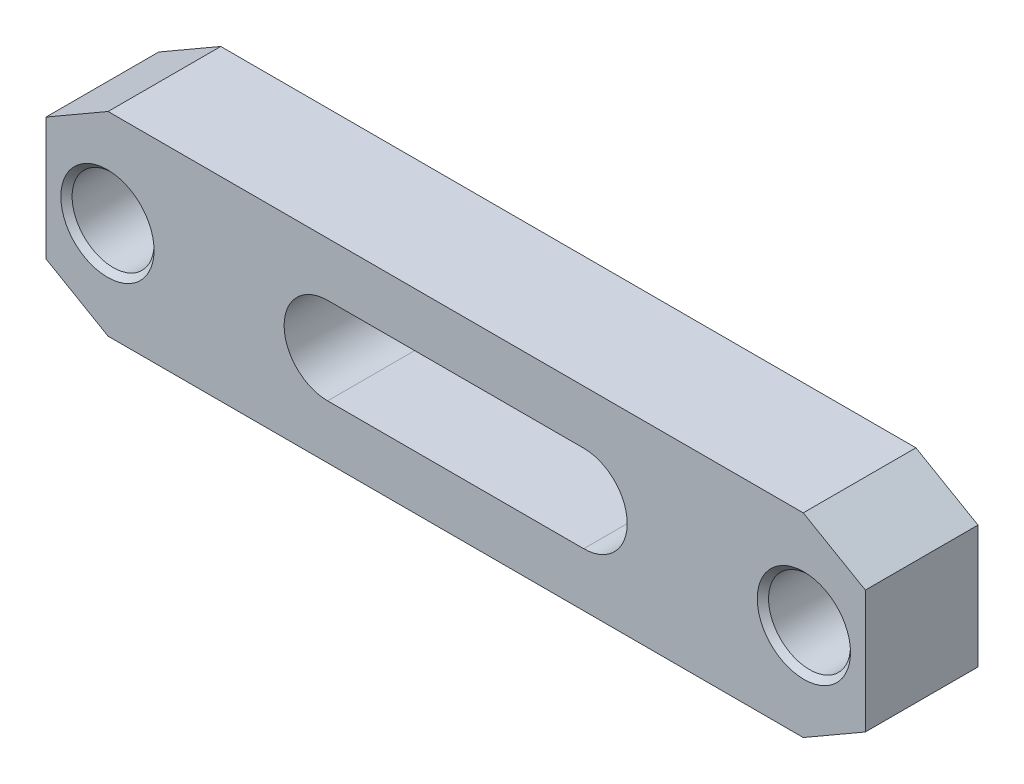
ISO-10303-21;
HEADER;
FILE_DESCRIPTION(('STEP AP214'),'2;1');
FILE_NAME('part.step','',(''),(''),'','','');
FILE_SCHEMA(('AUTOMOTIVE_DESIGN { 1 0 10303 214 1 1 1 1 }'));
ENDSEC;
DATA;
#1=APPLICATION_CONTEXT('core data for automotive mechanical design processes');
#2=APPLICATION_PROTOCOL_DEFINITION('international standard','automotive_design',2000,#1);
#3=PRODUCT_CONTEXT('',#1,'mechanical');
#4=PRODUCT('Part','Part','',(#3));
#5=PRODUCT_RELATED_PRODUCT_CATEGORY('part','',(#4));
#6=PRODUCT_DEFINITION_FORMATION('','',#4);
#7=PRODUCT_DEFINITION_CONTEXT('part definition',#1,'design');
#8=PRODUCT_DEFINITION('design','',#6,#7);
#9=PRODUCT_DEFINITION_SHAPE('','',#8);
#10=(LENGTH_UNIT() NAMED_UNIT(*) SI_UNIT(.MILLI.,.METRE.));
#11=(NAMED_UNIT(*) PLANE_ANGLE_UNIT() SI_UNIT($,.RADIAN.));
#12=(NAMED_UNIT(*) SI_UNIT($,.STERADIAN.) SOLID_ANGLE_UNIT());
#13=UNCERTAINTY_MEASURE_WITH_UNIT(LENGTH_MEASURE(1.E-05),#10,'distance_accuracy_value','');
#14=(GEOMETRIC_REPRESENTATION_CONTEXT(3) GLOBAL_UNCERTAINTY_ASSIGNED_CONTEXT((#13)) GLOBAL_UNIT_ASSIGNED_CONTEXT((#10,
#11,#12)) REPRESENTATION_CONTEXT('',''));
#15=CARTESIAN_POINT('',(0.,0.,0.));
#16=DIRECTION('',(0.,0.,1.));
#17=DIRECTION('',(1.,0.,0.));
#18=AXIS2_PLACEMENT_3D('',#15,#16,#17);
#19=CARTESIAN_POINT('',(80.,-19.,22.));
#20=DIRECTION('',(0.,0.,1.));
#21=DIRECTION('',(1.,0.,0.));
#22=AXIS2_PLACEMENT_3D('',#19,#20,#21);
#23=PLANE('',#22);
#24=CARTESIAN_POINT('',(68.,0.,22.));
#25=DIRECTION('',(0.,0.,-1.));
#26=DIRECTION('',(-1.,0.,0.));
#27=AXIS2_PLACEMENT_3D('',#24,#25,#26);
#28=CIRCLE('',#27,9.1);
#29=CARTESIAN_POINT('',(58.9,0.,22.));
#30=VERTEX_POINT('',#29);
#31=EDGE_CURVE('E212',#30,#30,#28,.T.);
#32=ORIENTED_EDGE('',*,*,#31,.T.);
#33=EDGE_LOOP('',(#32));
#34=FACE_BOUND('',#33,.T.);
#35=CARTESIAN_POINT('',(-68.,0.,22.));
#36=DIRECTION('',(0.,0.,-1.));
#37=DIRECTION('',(-1.,0.,0.));
#38=AXIS2_PLACEMENT_3D('',#35,#36,#37);
#39=CIRCLE('',#38,9.1);
#40=CARTESIAN_POINT('',(-77.1,0.,22.));
#41=VERTEX_POINT('',#40);
#42=EDGE_CURVE('E133',#41,#41,#39,.T.);
#43=ORIENTED_EDGE('',*,*,#42,.T.);
#44=EDGE_LOOP('',(#43));
#45=FACE_BOUND('',#44,.T.);
#46=DIRECTION('',(1.,0.,0.));
#47=VECTOR('',#46,1.);
#48=CARTESIAN_POINT('',(-67.8756443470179,-19.,22.));
#49=LINE('',#48,#47);
#50=CARTESIAN_POINT('',(-67.8756443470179,-19.,22.));
#51=VERTEX_POINT('',#50);
#52=CARTESIAN_POINT('',(67.8756443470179,-19.,22.));
#53=VERTEX_POINT('',#52);
#54=EDGE_CURVE('E143',#51,#53,#49,.T.);
#55=ORIENTED_EDGE('',*,*,#54,.T.);
#56=DIRECTION('',(0.866025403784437,0.5,0.));
#57=VECTOR('',#56,1.);
#58=CARTESIAN_POINT('',(67.8756443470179,-19.,22.));
#59=LINE('',#58,#57);
#60=CARTESIAN_POINT('',(80.,-12.,22.));
#61=VERTEX_POINT('',#60);
#62=EDGE_CURVE('E146',#53,#61,#59,.T.);
#63=ORIENTED_EDGE('',*,*,#62,.T.);
#64=DIRECTION('',(0.,1.,0.));
#65=VECTOR('',#64,1.);
#66=CARTESIAN_POINT('',(80.,-12.,22.));
#67=LINE('',#66,#65);
#68=CARTESIAN_POINT('',(80.,12.,22.));
#69=VERTEX_POINT('',#68);
#70=EDGE_CURVE('E149',#61,#69,#67,.T.);
#71=ORIENTED_EDGE('',*,*,#70,.T.);
#72=DIRECTION('',(-0.866025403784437,0.5,0.));
#73=VECTOR('',#72,1.);
#74=CARTESIAN_POINT('',(67.8756443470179,19.,22.));
#75=LINE('',#74,#73);
#76=CARTESIAN_POINT('',(67.8756443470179,19.,22.));
#77=VERTEX_POINT('',#76);
#78=EDGE_CURVE('E151',#69,#77,#75,.T.);
#79=ORIENTED_EDGE('',*,*,#78,.T.);
#80=DIRECTION('',(-1.,0.,0.));
#81=VECTOR('',#80,1.);
#82=CARTESIAN_POINT('',(-67.8756443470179,19.,22.));
#83=LINE('',#82,#81);
#84=CARTESIAN_POINT('',(-67.8756443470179,19.,22.));
#85=VERTEX_POINT('',#84);
#86=EDGE_CURVE('E153',#77,#85,#83,.T.);
#87=ORIENTED_EDGE('',*,*,#86,.T.);
#88=DIRECTION('',(-0.866025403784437,-0.5,0.));
#89=VECTOR('',#88,1.);
#90=CARTESIAN_POINT('',(-67.8756443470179,19.,22.));
#91=LINE('',#90,#89);
#92=CARTESIAN_POINT('',(-80.,12.,22.));
#93=VERTEX_POINT('',#92);
#94=EDGE_CURVE('E155',#85,#93,#91,.T.);
#95=ORIENTED_EDGE('',*,*,#94,.T.);
#96=DIRECTION('',(0.,-1.,0.));
#97=VECTOR('',#96,1.);
#98=CARTESIAN_POINT('',(-80.,-12.,22.));
#99=LINE('',#98,#97);
#100=CARTESIAN_POINT('',(-80.,-12.,22.));
#101=VERTEX_POINT('',#100);
#102=EDGE_CURVE('E157',#93,#101,#99,.T.);
#103=ORIENTED_EDGE('',*,*,#102,.T.);
#104=DIRECTION('',(0.866025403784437,-0.5,0.));
#105=VECTOR('',#104,1.);
#106=CARTESIAN_POINT('',(-67.8756443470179,-19.,22.));
#107=LINE('',#106,#105);
#108=EDGE_CURVE('E159',#101,#51,#107,.T.);
#109=ORIENTED_EDGE('',*,*,#108,.T.);
#110=EDGE_LOOP('',(#55,#63,#71,#79,#87,#95,#103,#109));
#111=FACE_BOUND('',#110,.T.);
#112=DIRECTION('',(-1.,0.,0.));
#113=VECTOR('',#112,1.);
#114=CARTESIAN_POINT('',(25.,8.5,22.));
#115=LINE('',#114,#113);
#116=CARTESIAN_POINT('',(25.,8.5,22.));
#117=VERTEX_POINT('',#116);
#118=CARTESIAN_POINT('',(-25.,8.5,22.));
#119=VERTEX_POINT('',#118);
#120=EDGE_CURVE('E113',#117,#119,#115,.T.);
#121=ORIENTED_EDGE('',*,*,#120,.F.);
#122=CARTESIAN_POINT('',(25.,0.,22.));
#123=DIRECTION('',(0.,0.,1.));
#124=DIRECTION('',(1.,0.,0.));
#125=AXIS2_PLACEMENT_3D('',#122,#123,#124);
#126=CIRCLE('',#125,8.5);
#127=CARTESIAN_POINT('',(25.,-8.5,22.));
#128=VERTEX_POINT('',#127);
#129=EDGE_CURVE('E105',#128,#117,#126,.T.);
#130=ORIENTED_EDGE('',*,*,#129,.F.);
#131=DIRECTION('',(1.,0.,0.));
#132=VECTOR('',#131,1.);
#133=CARTESIAN_POINT('',(25.,-8.5,22.));
#134=LINE('',#133,#132);
#135=CARTESIAN_POINT('',(-25.,-8.5,22.));
#136=VERTEX_POINT('',#135);
#137=EDGE_CURVE('E127',#136,#128,#134,.T.);
#138=ORIENTED_EDGE('',*,*,#137,.F.);
#139=CARTESIAN_POINT('',(-25.,0.,22.));
#140=DIRECTION('',(0.,0.,1.));
#141=DIRECTION('',(1.,0.,0.));
#142=AXIS2_PLACEMENT_3D('',#139,#140,#141);
#143=CIRCLE('',#142,8.5);
#144=EDGE_CURVE('E125',#119,#136,#143,.T.);
#145=ORIENTED_EDGE('',*,*,#144,.F.);
#146=EDGE_LOOP('',(#121,#130,#138,#145));
#147=FACE_BOUND('',#146,.T.);
#148=ADVANCED_FACE('F14',(#34,#45,#111,#147),#23,.T.);
#149=CARTESIAN_POINT('',(80.,-19.,0.));
#150=DIRECTION('',(0.,0.,1.));
#151=DIRECTION('',(1.,0.,0.));
#152=AXIS2_PLACEMENT_3D('',#149,#150,#151);
#153=PLANE('',#152);
#154=CARTESIAN_POINT('',(68.,0.,0.));
#155=DIRECTION('',(0.,0.,-1.));
#156=DIRECTION('',(-1.,0.,0.));
#157=AXIS2_PLACEMENT_3D('',#154,#155,#156);
#158=CIRCLE('',#157,9.1);
#159=CARTESIAN_POINT('',(58.9,0.,0.));
#160=VERTEX_POINT('',#159);
#161=EDGE_CURVE('E202',#160,#160,#158,.T.);
#162=ORIENTED_EDGE('',*,*,#161,.F.);
#163=EDGE_LOOP('',(#162));
#164=FACE_BOUND('',#163,.T.);
#165=CARTESIAN_POINT('',(-68.,0.,0.));
#166=DIRECTION('',(0.,0.,-1.));
#167=DIRECTION('',(-1.,0.,0.));
#168=AXIS2_PLACEMENT_3D('',#165,#166,#167);
#169=CIRCLE('',#168,9.1);
#170=CARTESIAN_POINT('',(-77.1,0.,0.));
#171=VERTEX_POINT('',#170);
#172=EDGE_CURVE('E215',#171,#171,#169,.T.);
#173=ORIENTED_EDGE('',*,*,#172,.F.);
#174=EDGE_LOOP('',(#173));
#175=FACE_BOUND('',#174,.T.);
#176=DIRECTION('',(1.,0.,0.));
#177=VECTOR('',#176,1.);
#178=CARTESIAN_POINT('',(-67.8756443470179,-19.,0.));
#179=LINE('',#178,#177);
#180=CARTESIAN_POINT('',(-67.8756443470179,-19.,0.));
#181=VERTEX_POINT('',#180);
#182=CARTESIAN_POINT('',(67.8756443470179,-19.,0.));
#183=VERTEX_POINT('',#182);
#184=EDGE_CURVE('E121',#181,#183,#179,.T.);
#185=ORIENTED_EDGE('',*,*,#184,.F.);
#186=DIRECTION('',(0.866025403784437,-0.5,0.));
#187=VECTOR('',#186,1.);
#188=CARTESIAN_POINT('',(-67.8756443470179,-19.,0.));
#189=LINE('',#188,#187);
#190=CARTESIAN_POINT('',(-80.,-12.,0.));
#191=VERTEX_POINT('',#190);
#192=EDGE_CURVE('E147',#191,#181,#189,.T.);
#193=ORIENTED_EDGE('',*,*,#192,.F.);
#194=DIRECTION('',(0.,-1.,0.));
#195=VECTOR('',#194,1.);
#196=CARTESIAN_POINT('',(-80.,-12.,0.));
#197=LINE('',#196,#195);
#198=CARTESIAN_POINT('',(-80.,12.,0.));
#199=VERTEX_POINT('',#198);
#200=EDGE_CURVE('E174',#199,#191,#197,.T.);
#201=ORIENTED_EDGE('',*,*,#200,.F.);
#202=DIRECTION('',(-0.866025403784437,-0.5,0.));
#203=VECTOR('',#202,1.);
#204=CARTESIAN_POINT('',(-67.8756443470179,19.,0.));
#205=LINE('',#204,#203);
#206=CARTESIAN_POINT('',(-67.8756443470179,19.,0.));
#207=VERTEX_POINT('',#206);
#208=EDGE_CURVE('E172',#207,#199,#205,.T.);
#209=ORIENTED_EDGE('',*,*,#208,.F.);
#210=DIRECTION('',(-1.,0.,0.));
#211=VECTOR('',#210,1.);
#212=CARTESIAN_POINT('',(-67.8756443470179,19.,0.));
#213=LINE('',#212,#211);
#214=CARTESIAN_POINT('',(67.8756443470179,19.,0.));
#215=VERTEX_POINT('',#214);
#216=EDGE_CURVE('E170',#215,#207,#213,.T.);
#217=ORIENTED_EDGE('',*,*,#216,.F.);
#218=DIRECTION('',(-0.866025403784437,0.5,0.));
#219=VECTOR('',#218,1.);
#220=CARTESIAN_POINT('',(67.8756443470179,19.,0.));
#221=LINE('',#220,#219);
#222=CARTESIAN_POINT('',(80.,12.,0.));
#223=VERTEX_POINT('',#222);
#224=EDGE_CURVE('E168',#223,#215,#221,.T.);
#225=ORIENTED_EDGE('',*,*,#224,.F.);
#226=DIRECTION('',(0.,1.,0.));
#227=VECTOR('',#226,1.);
#228=CARTESIAN_POINT('',(80.,-12.,0.));
#229=LINE('',#228,#227);
#230=CARTESIAN_POINT('',(80.,-12.,0.));
#231=VERTEX_POINT('',#230);
#232=EDGE_CURVE('E166',#231,#223,#229,.T.);
#233=ORIENTED_EDGE('',*,*,#232,.F.);
#234=DIRECTION('',(0.866025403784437,0.5,0.));
#235=VECTOR('',#234,1.);
#236=CARTESIAN_POINT('',(67.8756443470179,-19.,0.));
#237=LINE('',#236,#235);
#238=EDGE_CURVE('E164',#183,#231,#237,.T.);
#239=ORIENTED_EDGE('',*,*,#238,.F.);
#240=EDGE_LOOP('',(#185,#193,#201,#209,#217,#225,#233,#239));
#241=FACE_BOUND('',#240,.T.);
#242=CARTESIAN_POINT('',(25.,0.,0.));
#243=DIRECTION('',(0.,0.,1.));
#244=DIRECTION('',(1.,0.,0.));
#245=AXIS2_PLACEMENT_3D('',#242,#243,#244);
#246=CIRCLE('',#245,8.5);
#247=CARTESIAN_POINT('',(25.,-8.5,0.));
#248=VERTEX_POINT('',#247);
#249=CARTESIAN_POINT('',(25.,8.5,0.));
#250=VERTEX_POINT('',#249);
#251=EDGE_CURVE('E39',#248,#250,#246,.T.);
#252=ORIENTED_EDGE('',*,*,#251,.T.);
#253=DIRECTION('',(-1.,0.,0.));
#254=VECTOR('',#253,1.);
#255=CARTESIAN_POINT('',(25.,8.5,0.));
#256=LINE('',#255,#254);
#257=CARTESIAN_POINT('',(-25.,8.5,0.));
#258=VERTEX_POINT('',#257);
#259=EDGE_CURVE('E120',#250,#258,#256,.T.);
#260=ORIENTED_EDGE('',*,*,#259,.T.);
#261=CARTESIAN_POINT('',(-25.,0.,0.));
#262=DIRECTION('',(0.,0.,1.));
#263=DIRECTION('',(1.,0.,0.));
#264=AXIS2_PLACEMENT_3D('',#261,#262,#263);
#265=CIRCLE('',#264,8.5);
#266=CARTESIAN_POINT('',(-25.,-8.5,0.));
#267=VERTEX_POINT('',#266);
#268=EDGE_CURVE('E135',#258,#267,#265,.T.);
#269=ORIENTED_EDGE('',*,*,#268,.T.);
#270=DIRECTION('',(1.,0.,0.));
#271=VECTOR('',#270,1.);
#272=CARTESIAN_POINT('',(25.,-8.5,0.));
#273=LINE('',#272,#271);
#274=EDGE_CURVE('E114',#267,#248,#273,.T.);
#275=ORIENTED_EDGE('',*,*,#274,.T.);
#276=EDGE_LOOP('',(#252,#260,#269,#275));
#277=FACE_BOUND('',#276,.T.);
#278=ADVANCED_FACE('F238',(#164,#175,#241,#277),#153,.F.);
#279=CARTESIAN_POINT('',(-67.8756443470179,-19.,22.));
#280=DIRECTION('',(0.,1.,0.));
#281=DIRECTION('',(-1.,0.,0.));
#282=AXIS2_PLACEMENT_3D('',#279,#280,#281);
#283=PLANE('',#282);
#284=ORIENTED_EDGE('',*,*,#184,.T.);
#285=DIRECTION('',(0.,0.,-1.));
#286=VECTOR('',#285,1.);
#287=CARTESIAN_POINT('',(67.8756443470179,-19.,22.));
#288=LINE('',#287,#286);
#289=EDGE_CURVE('E9',#53,#183,#288,.T.);
#290=ORIENTED_EDGE('',*,*,#289,.F.);
#291=ORIENTED_EDGE('',*,*,#54,.F.);
#292=DIRECTION('',(0.,0.,-1.));
#293=VECTOR('',#292,1.);
#294=CARTESIAN_POINT('',(-67.8756443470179,-19.,22.));
#295=LINE('',#294,#293);
#296=EDGE_CURVE('E161',#51,#181,#295,.T.);
#297=ORIENTED_EDGE('',*,*,#296,.T.);
#298=EDGE_LOOP('',(#284,#290,#291,#297));
#299=FACE_BOUND('',#298,.T.);
#300=ADVANCED_FACE('F16',(#299),#283,.F.);
#301=CARTESIAN_POINT('',(67.8756443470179,-19.,22.));
#302=DIRECTION('',(-0.5,0.866025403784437,0.));
#303=DIRECTION('',(-0.866025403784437,-0.5,0.));
#304=AXIS2_PLACEMENT_3D('',#301,#302,#303);
#305=PLANE('',#304);
#306=ORIENTED_EDGE('',*,*,#238,.T.);
#307=DIRECTION('',(0.,0.,-1.));
#308=VECTOR('',#307,1.);
#309=CARTESIAN_POINT('',(80.,-12.,22.));
#310=LINE('',#309,#308);
#311=EDGE_CURVE('E23',#61,#231,#310,.T.);
#312=ORIENTED_EDGE('',*,*,#311,.F.);
#313=ORIENTED_EDGE('',*,*,#62,.F.);
#314=ORIENTED_EDGE('',*,*,#289,.T.);
#315=EDGE_LOOP('',(#306,#312,#313,#314));
#316=FACE_BOUND('',#315,.T.);
#317=ADVANCED_FACE('F271',(#316),#305,.F.);
#318=CARTESIAN_POINT('',(80.,-12.,22.));
#319=DIRECTION('',(-1.,0.,0.));
#320=DIRECTION('',(0.,0.,1.));
#321=AXIS2_PLACEMENT_3D('',#318,#319,#320);
#322=PLANE('',#321);
#323=ORIENTED_EDGE('',*,*,#232,.T.);
#324=DIRECTION('',(0.,0.,-1.));
#325=VECTOR('',#324,1.);
#326=CARTESIAN_POINT('',(80.,12.,22.));
#327=LINE('',#326,#325);
#328=EDGE_CURVE('E191',#69,#223,#327,.T.);
#329=ORIENTED_EDGE('',*,*,#328,.F.);
#330=ORIENTED_EDGE('',*,*,#70,.F.);
#331=ORIENTED_EDGE('',*,*,#311,.T.);
#332=EDGE_LOOP('',(#323,#329,#330,#331));
#333=FACE_BOUND('',#332,.T.);
#334=ADVANCED_FACE('F268',(#333),#322,.F.);
#335=CARTESIAN_POINT('',(67.8756443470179,19.,22.));
#336=DIRECTION('',(-0.5,-0.866025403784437,0.));
#337=DIRECTION('',(0.866025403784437,-0.5,0.));
#338=AXIS2_PLACEMENT_3D('',#335,#336,#337);
#339=PLANE('',#338);
#340=ORIENTED_EDGE('',*,*,#224,.T.);
#341=DIRECTION('',(0.,0.,-1.));
#342=VECTOR('',#341,1.);
#343=CARTESIAN_POINT('',(67.8756443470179,19.,22.));
#344=LINE('',#343,#342);
#345=EDGE_CURVE('E188',#77,#215,#344,.T.);
#346=ORIENTED_EDGE('',*,*,#345,.F.);
#347=ORIENTED_EDGE('',*,*,#78,.F.);
#348=ORIENTED_EDGE('',*,*,#328,.T.);
#349=EDGE_LOOP('',(#340,#346,#347,#348));
#350=FACE_BOUND('',#349,.T.);
#351=ADVANCED_FACE('F264',(#350),#339,.F.);
#352=CARTESIAN_POINT('',(-67.8756443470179,19.,22.));
#353=DIRECTION('',(0.,-1.,0.));
#354=DIRECTION('',(0.,0.,-1.));
#355=AXIS2_PLACEMENT_3D('',#352,#353,#354);
#356=PLANE('',#355);
#357=ORIENTED_EDGE('',*,*,#216,.T.);
#358=DIRECTION('',(0.,0.,-1.));
#359=VECTOR('',#358,1.);
#360=CARTESIAN_POINT('',(-67.8756443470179,19.,22.));
#361=LINE('',#360,#359);
#362=EDGE_CURVE('E185',#85,#207,#361,.T.);
#363=ORIENTED_EDGE('',*,*,#362,.F.);
#364=ORIENTED_EDGE('',*,*,#86,.F.);
#365=ORIENTED_EDGE('',*,*,#345,.T.);
#366=EDGE_LOOP('',(#357,#363,#364,#365));
#367=FACE_BOUND('',#366,.T.);
#368=ADVANCED_FACE('F260',(#367),#356,.F.);
#369=CARTESIAN_POINT('',(-67.8756443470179,19.,22.));
#370=DIRECTION('',(0.5,-0.866025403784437,0.));
#371=DIRECTION('',(0.866025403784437,0.5,0.));
#372=AXIS2_PLACEMENT_3D('',#369,#370,#371);
#373=PLANE('',#372);
#374=ORIENTED_EDGE('',*,*,#208,.T.);
#375=DIRECTION('',(0.,0.,-1.));
#376=VECTOR('',#375,1.);
#377=CARTESIAN_POINT('',(-80.,12.,22.));
#378=LINE('',#377,#376);
#379=EDGE_CURVE('E182',#93,#199,#378,.T.);
#380=ORIENTED_EDGE('',*,*,#379,.F.);
#381=ORIENTED_EDGE('',*,*,#94,.F.);
#382=ORIENTED_EDGE('',*,*,#362,.T.);
#383=EDGE_LOOP('',(#374,#380,#381,#382));
#384=FACE_BOUND('',#383,.T.);
#385=ADVANCED_FACE('F256',(#384),#373,.F.);
#386=CARTESIAN_POINT('',(-80.,-12.,22.));
#387=DIRECTION('',(1.,0.,0.));
#388=DIRECTION('',(0.,0.,-1.));
#389=AXIS2_PLACEMENT_3D('',#386,#387,#388);
#390=PLANE('',#389);
#391=ORIENTED_EDGE('',*,*,#200,.T.);
#392=DIRECTION('',(0.,0.,-1.));
#393=VECTOR('',#392,1.);
#394=CARTESIAN_POINT('',(-80.,-12.,22.));
#395=LINE('',#394,#393);
#396=EDGE_CURVE('E179',#101,#191,#395,.T.);
#397=ORIENTED_EDGE('',*,*,#396,.F.);
#398=ORIENTED_EDGE('',*,*,#102,.F.);
#399=ORIENTED_EDGE('',*,*,#379,.T.);
#400=EDGE_LOOP('',(#391,#397,#398,#399));
#401=FACE_BOUND('',#400,.T.);
#402=ADVANCED_FACE('F252',(#401),#390,.F.);
#403=CARTESIAN_POINT('',(-67.8756443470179,-19.,22.));
#404=DIRECTION('',(0.5,0.866025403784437,0.));
#405=DIRECTION('',(-0.866025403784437,0.5,0.));
#406=AXIS2_PLACEMENT_3D('',#403,#404,#405);
#407=PLANE('',#406);
#408=ORIENTED_EDGE('',*,*,#192,.T.);
#409=ORIENTED_EDGE('',*,*,#296,.F.);
#410=ORIENTED_EDGE('',*,*,#108,.F.);
#411=ORIENTED_EDGE('',*,*,#396,.T.);
#412=EDGE_LOOP('',(#408,#409,#410,#411));
#413=FACE_BOUND('',#412,.T.);
#414=ADVANCED_FACE('F249',(#413),#407,.F.);
#415=CARTESIAN_POINT('',(25.,0.,22.));
#416=DIRECTION('',(0.,0.,-1.));
#417=DIRECTION('',(-1.,0.,0.));
#418=AXIS2_PLACEMENT_3D('',#415,#416,#417);
#419=CYLINDRICAL_SURFACE('',#418,8.5);
#420=ORIENTED_EDGE('',*,*,#251,.F.);
#421=DIRECTION('',(0.,0.,-1.));
#422=VECTOR('',#421,1.);
#423=CARTESIAN_POINT('',(25.,-8.5,22.));
#424=LINE('',#423,#422);
#425=EDGE_CURVE('E109',#128,#248,#424,.T.);
#426=ORIENTED_EDGE('',*,*,#425,.F.);
#427=ORIENTED_EDGE('',*,*,#129,.T.);
#428=DIRECTION('',(0.,0.,-1.));
#429=VECTOR('',#428,1.);
#430=CARTESIAN_POINT('',(25.,8.5,22.));
#431=LINE('',#430,#429);
#432=EDGE_CURVE('E108',#117,#250,#431,.T.);
#433=ORIENTED_EDGE('',*,*,#432,.T.);
#434=EDGE_LOOP('',(#420,#426,#427,#433));
#435=FACE_BOUND('',#434,.T.);
#436=ADVANCED_FACE('F107',(#435),#419,.F.);
#437=CARTESIAN_POINT('',(25.,8.5,22.));
#438=DIRECTION('',(0.,-1.,0.));
#439=DIRECTION('',(1.,0.,0.));
#440=AXIS2_PLACEMENT_3D('',#437,#438,#439);
#441=PLANE('',#440);
#442=ORIENTED_EDGE('',*,*,#259,.F.);
#443=ORIENTED_EDGE('',*,*,#432,.F.);
#444=ORIENTED_EDGE('',*,*,#120,.T.);
#445=DIRECTION('',(0.,0.,-1.));
#446=VECTOR('',#445,1.);
#447=CARTESIAN_POINT('',(-25.,8.5,22.));
#448=LINE('',#447,#446);
#449=EDGE_CURVE('E122',#119,#258,#448,.T.);
#450=ORIENTED_EDGE('',*,*,#449,.T.);
#451=EDGE_LOOP('',(#442,#443,#444,#450));
#452=FACE_BOUND('',#451,.T.);
#453=ADVANCED_FACE('F117',(#452),#441,.T.);
#454=CARTESIAN_POINT('',(-25.,0.,22.));
#455=DIRECTION('',(0.,0.,-1.));
#456=DIRECTION('',(-1.,0.,0.));
#457=AXIS2_PLACEMENT_3D('',#454,#455,#456);
#458=CYLINDRICAL_SURFACE('',#457,8.5);
#459=ORIENTED_EDGE('',*,*,#268,.F.);
#460=ORIENTED_EDGE('',*,*,#449,.F.);
#461=ORIENTED_EDGE('',*,*,#144,.T.);
#462=DIRECTION('',(0.,0.,-1.));
#463=VECTOR('',#462,1.);
#464=CARTESIAN_POINT('',(-25.,-8.5,22.));
#465=LINE('',#464,#463);
#466=EDGE_CURVE('E31',#136,#267,#465,.T.);
#467=ORIENTED_EDGE('',*,*,#466,.T.);
#468=EDGE_LOOP('',(#459,#460,#461,#467));
#469=FACE_BOUND('',#468,.T.);
#470=ADVANCED_FACE('F235',(#469),#458,.F.);
#471=CARTESIAN_POINT('',(25.,-8.5,22.));
#472=DIRECTION('',(0.,1.,0.));
#473=DIRECTION('',(-1.,0.,0.));
#474=AXIS2_PLACEMENT_3D('',#471,#472,#473);
#475=PLANE('',#474);
#476=ORIENTED_EDGE('',*,*,#274,.F.);
#477=ORIENTED_EDGE('',*,*,#466,.F.);
#478=ORIENTED_EDGE('',*,*,#137,.T.);
#479=ORIENTED_EDGE('',*,*,#425,.T.);
#480=EDGE_LOOP('',(#476,#477,#478,#479));
#481=FACE_BOUND('',#480,.T.);
#482=ADVANCED_FACE('F225',(#481),#475,.T.);
#483=CARTESIAN_POINT('',(-68.,0.,20.));
#484=DIRECTION('',(0.,0.,1.));
#485=DIRECTION('',(1.,0.,0.));
#486=AXIS2_PLACEMENT_3D('',#483,#484,#485);
#487=CONICAL_SURFACE('',#486,7.1,0.785398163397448);
#488=CARTESIAN_POINT('',(-68.,0.,20.9));
#489=DIRECTION('',(0.,0.,1.));
#490=DIRECTION('',(1.,0.,0.));
#491=AXIS2_PLACEMENT_3D('',#488,#489,#490);
#492=CIRCLE('',#491,8.);
#493=CARTESIAN_POINT('',(-60.,0.,20.9));
#494=VERTEX_POINT('',#493);
#495=EDGE_CURVE('E197',#494,#494,#492,.F.);
#496=ORIENTED_EDGE('',*,*,#495,.T.);
#497=EDGE_LOOP('',(#496));
#498=FACE_BOUND('',#497,.T.);
#499=ORIENTED_EDGE('',*,*,#42,.F.);
#500=EDGE_LOOP('',(#499));
#501=FACE_BOUND('',#500,.T.);
#502=ADVANCED_FACE('F222',(#498,#501),#487,.F.);
#503=CARTESIAN_POINT('',(-68.,0.,0.));
#504=DIRECTION('',(0.,0.,-1.));
#505=DIRECTION('',(-1.,0.,0.));
#506=AXIS2_PLACEMENT_3D('',#503,#504,#505);
#507=CONICAL_SURFACE('',#506,9.1,0.78539816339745);
#508=CARTESIAN_POINT('',(-68.,0.,1.1));
#509=DIRECTION('',(0.,0.,-1.));
#510=DIRECTION('',(-1.,0.,0.));
#511=AXIS2_PLACEMENT_3D('',#508,#509,#510);
#512=CIRCLE('',#511,8.);
#513=CARTESIAN_POINT('',(-76.,0.,1.1));
#514=VERTEX_POINT('',#513);
#515=EDGE_CURVE('E195',#514,#514,#512,.F.);
#516=ORIENTED_EDGE('',*,*,#515,.T.);
#517=EDGE_LOOP('',(#516));
#518=FACE_BOUND('',#517,.T.);
#519=ORIENTED_EDGE('',*,*,#172,.T.);
#520=EDGE_LOOP('',(#519));
#521=FACE_BOUND('',#520,.T.);
#522=ADVANCED_FACE('F224',(#518,#521),#507,.F.);
#523=CARTESIAN_POINT('',(68.,0.,20.));
#524=DIRECTION('',(0.,0.,1.));
#525=DIRECTION('',(1.,0.,0.));
#526=AXIS2_PLACEMENT_3D('',#523,#524,#525);
#527=CONICAL_SURFACE('',#526,7.1,0.785398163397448);
#528=CARTESIAN_POINT('',(68.,0.,20.9));
#529=DIRECTION('',(0.,0.,1.));
#530=DIRECTION('',(1.,0.,0.));
#531=AXIS2_PLACEMENT_3D('',#528,#529,#530);
#532=CIRCLE('',#531,8.);
#533=CARTESIAN_POINT('',(76.,0.,20.9));
#534=VERTEX_POINT('',#533);
#535=EDGE_CURVE('E198',#534,#534,#532,.F.);
#536=ORIENTED_EDGE('',*,*,#535,.T.);
#537=EDGE_LOOP('',(#536));
#538=FACE_BOUND('',#537,.T.);
#539=ORIENTED_EDGE('',*,*,#31,.F.);
#540=EDGE_LOOP('',(#539));
#541=FACE_BOUND('',#540,.T.);
#542=ADVANCED_FACE('F233',(#538,#541),#527,.F.);
#543=CARTESIAN_POINT('',(68.,0.,0.));
#544=DIRECTION('',(0.,0.,-1.));
#545=DIRECTION('',(-1.,0.,0.));
#546=AXIS2_PLACEMENT_3D('',#543,#544,#545);
#547=CONICAL_SURFACE('',#546,9.1,0.785398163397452);
#548=CARTESIAN_POINT('',(68.,0.,1.09999999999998));
#549=DIRECTION('',(0.,0.,-1.));
#550=DIRECTION('',(-1.,0.,0.));
#551=AXIS2_PLACEMENT_3D('',#548,#549,#550);
#552=CIRCLE('',#551,8.);
#553=CARTESIAN_POINT('',(60.,0.,1.09999999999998));
#554=VERTEX_POINT('',#553);
#555=EDGE_CURVE('E18',#554,#554,#552,.F.);
#556=ORIENTED_EDGE('',*,*,#555,.T.);
#557=EDGE_LOOP('',(#556));
#558=FACE_BOUND('',#557,.T.);
#559=ORIENTED_EDGE('',*,*,#161,.T.);
#560=EDGE_LOOP('',(#559));
#561=FACE_BOUND('',#560,.T.);
#562=ADVANCED_FACE('F398',(#558,#561),#547,.F.);
#563=CARTESIAN_POINT('',(-68.,0.,0.));
#564=DIRECTION('',(0.,0.,1.));
#565=DIRECTION('',(1.,0.,0.));
#566=AXIS2_PLACEMENT_3D('',#563,#564,#565);
#567=CYLINDRICAL_SURFACE('',#566,8.);
#568=ORIENTED_EDGE('',*,*,#515,.F.);
#569=EDGE_LOOP('',(#568));
#570=FACE_BOUND('',#569,.T.);
#571=ORIENTED_EDGE('',*,*,#495,.F.);
#572=EDGE_LOOP('',(#571));
#573=FACE_BOUND('',#572,.T.);
#574=ADVANCED_FACE('F407',(#570,#573),#567,.F.);
#575=CARTESIAN_POINT('',(68.,0.,0.));
#576=DIRECTION('',(0.,0.,1.));
#577=DIRECTION('',(1.,0.,0.));
#578=AXIS2_PLACEMENT_3D('',#575,#576,#577);
#579=CYLINDRICAL_SURFACE('',#578,8.);
#580=ORIENTED_EDGE('',*,*,#555,.F.);
#581=EDGE_LOOP('',(#580));
#582=FACE_BOUND('',#581,.T.);
#583=ORIENTED_EDGE('',*,*,#535,.F.);
#584=EDGE_LOOP('',(#583));
#585=FACE_BOUND('',#584,.T.);
#586=ADVANCED_FACE('F417',(#582,#585),#579,.F.);
#587=CLOSED_SHELL('',(#148,#278,#300,#317,#334,#351,#368,#385,#402,#414,#436,#453,#470,#482,
#502,#522,#542,#562,#574,#586));
#588=MANIFOLD_SOLID_BREP('B1',#587);
#589=ADVANCED_BREP_SHAPE_REPRESENTATION('',(#18,#588),#14);
#590=SHAPE_DEFINITION_REPRESENTATION(#9,#589);
ENDSEC;
END-ISO-10303-21;
